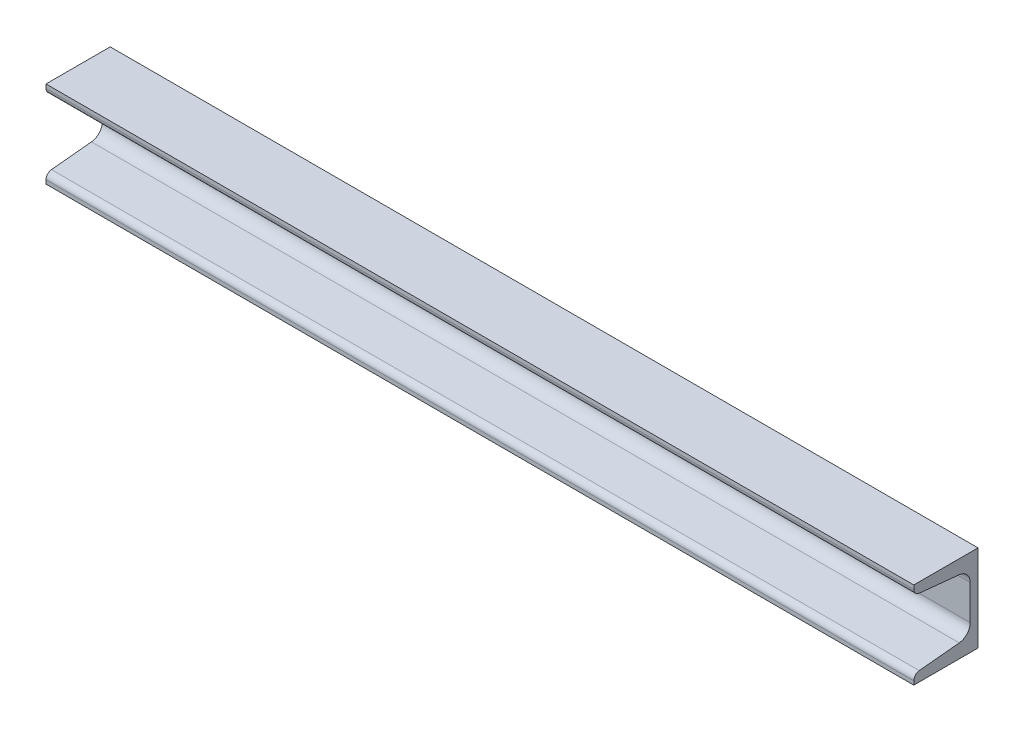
ISO-10303-21;
HEADER;
FILE_DESCRIPTION(('STEP AP214'),'2;1');
FILE_NAME('part.step','',(''),(''),'','','');
FILE_SCHEMA(('AUTOMOTIVE_DESIGN { 1 0 10303 214 1 1 1 1 }'));
ENDSEC;
DATA;
#1=APPLICATION_CONTEXT('core data for automotive mechanical design processes');
#2=APPLICATION_PROTOCOL_DEFINITION('international standard','automotive_design',2000,#1);
#3=PRODUCT_CONTEXT('',#1,'mechanical');
#4=PRODUCT('Part','Part','',(#3));
#5=PRODUCT_RELATED_PRODUCT_CATEGORY('part','',(#4));
#6=PRODUCT_DEFINITION_FORMATION('','',#4);
#7=PRODUCT_DEFINITION_CONTEXT('part definition',#1,'design');
#8=PRODUCT_DEFINITION('design','',#6,#7);
#9=PRODUCT_DEFINITION_SHAPE('','',#8);
#10=(LENGTH_UNIT() NAMED_UNIT(*) SI_UNIT(.MILLI.,.METRE.));
#11=(NAMED_UNIT(*) PLANE_ANGLE_UNIT() SI_UNIT($,.RADIAN.));
#12=(NAMED_UNIT(*) SI_UNIT($,.STERADIAN.) SOLID_ANGLE_UNIT());
#13=UNCERTAINTY_MEASURE_WITH_UNIT(LENGTH_MEASURE(1.E-05),#10,'distance_accuracy_value','');
#14=(GEOMETRIC_REPRESENTATION_CONTEXT(3) GLOBAL_UNCERTAINTY_ASSIGNED_CONTEXT((#13)) GLOBAL_UNIT_ASSIGNED_CONTEXT((#10,
#11,#12)) REPRESENTATION_CONTEXT('',''));
#15=CARTESIAN_POINT('',(0.,0.,0.));
#16=DIRECTION('',(0.,0.,1.));
#17=DIRECTION('',(1.,0.,0.));
#18=AXIS2_PLACEMENT_3D('',#15,#16,#17);
#19=CARTESIAN_POINT('',(500.,16.3749999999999,4.5));
#20=DIRECTION('',(0.,0.995037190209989,-0.0995037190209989));
#21=DIRECTION('',(0.,0.0995037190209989,0.995037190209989));
#22=AXIS2_PLACEMENT_3D('',#19,#20,#21);
#23=PLANE('',#22);
#24=DIRECTION('',(0.,-0.0995037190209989,-0.995037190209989));
#25=VECTOR('',#24,1.);
#26=CARTESIAN_POINT('',(500.,16.3749999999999,4.5));
#27=LINE('',#26,#25);
#28=CARTESIAN_POINT('',(500.,19.3098263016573,33.8482630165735));
#29=VERTEX_POINT('',#28);
#30=CARTESIAN_POINT('',(500.,17.0053473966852,10.803473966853));
#31=VERTEX_POINT('',#30);
#32=EDGE_CURVE('E180',#29,#31,#27,.T.);
#33=ORIENTED_EDGE('',*,*,#32,.F.);
#34=DIRECTION('',(-1.,0.,0.));
#35=VECTOR('',#34,1.);
#36=CARTESIAN_POINT('',(500.,19.3098263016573,33.8482630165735));
#37=LINE('',#36,#35);
#38=CARTESIAN_POINT('',(0.,19.3098263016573,33.8482630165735));
#39=VERTEX_POINT('',#38);
#40=EDGE_CURVE('E47',#29,#39,#37,.T.);
#41=ORIENTED_EDGE('',*,*,#40,.T.);
#42=DIRECTION('',(0.,-0.0995037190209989,-0.995037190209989));
#43=VECTOR('',#42,1.);
#44=CARTESIAN_POINT('',(0.,16.3749999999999,4.5));
#45=LINE('',#44,#43);
#46=CARTESIAN_POINT('',(0.,17.0053473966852,10.803473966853));
#47=VERTEX_POINT('',#46);
#48=EDGE_CURVE('E163',#39,#47,#45,.T.);
#49=ORIENTED_EDGE('',*,*,#48,.T.);
#50=DIRECTION('',(-1.,0.,0.));
#51=VECTOR('',#50,1.);
#52=CARTESIAN_POINT('',(500.,17.0053473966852,10.803473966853));
#53=LINE('',#52,#51);
#54=EDGE_CURVE('E194',#47,#31,#53,.F.);
#55=ORIENTED_EDGE('',*,*,#54,.T.);
#56=EDGE_LOOP('',(#33,#41,#49,#55));
#57=FACE_BOUND('',#56,.T.);
#58=ADVANCED_FACE('F39',(#57),#23,.F.);
#59=CARTESIAN_POINT('',(500.,-16.3750000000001,4.5));
#60=DIRECTION('',(0.,0.,-1.));
#61=DIRECTION('',(-1.,0.,0.));
#62=AXIS2_PLACEMENT_3D('',#59,#60,#61);
#63=PLANE('',#62);
#64=DIRECTION('',(0.,-1.,0.));
#65=VECTOR('',#64,1.);
#66=CARTESIAN_POINT('',(0.,-16.3750000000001,4.5));
#67=LINE('',#66,#65);
#68=CARTESIAN_POINT('',(0.,10.0400870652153,4.5));
#69=VERTEX_POINT('',#68);
#70=CARTESIAN_POINT('',(0.,-10.0400870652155,4.5));
#71=VERTEX_POINT('',#70);
#72=EDGE_CURVE('E165',#69,#71,#67,.T.);
#73=ORIENTED_EDGE('',*,*,#72,.T.);
#74=DIRECTION('',(-1.,0.,0.));
#75=VECTOR('',#74,1.);
#76=CARTESIAN_POINT('',(500.,-10.0400870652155,4.5));
#77=LINE('',#76,#75);
#78=CARTESIAN_POINT('',(500.,-10.0400870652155,4.5));
#79=VERTEX_POINT('',#78);
#80=EDGE_CURVE('E192',#71,#79,#77,.F.);
#81=ORIENTED_EDGE('',*,*,#80,.T.);
#82=DIRECTION('',(0.,-1.,0.));
#83=VECTOR('',#82,1.);
#84=CARTESIAN_POINT('',(500.,-16.3750000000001,4.5));
#85=LINE('',#84,#83);
#86=CARTESIAN_POINT('',(500.,10.0400870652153,4.5));
#87=VERTEX_POINT('',#86);
#88=EDGE_CURVE('E231',#87,#79,#85,.T.);
#89=ORIENTED_EDGE('',*,*,#88,.F.);
#90=DIRECTION('',(-1.,0.,0.));
#91=VECTOR('',#90,1.);
#92=CARTESIAN_POINT('',(1.11022302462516E-13,10.0400870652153,4.5));
#93=LINE('',#92,#91);
#94=EDGE_CURVE('E189',#87,#69,#93,.T.);
#95=ORIENTED_EDGE('',*,*,#94,.T.);
#96=EDGE_LOOP('',(#73,#81,#89,#95));
#97=FACE_BOUND('',#96,.T.);
#98=ADVANCED_FACE('F234',(#97),#63,.F.);
#99=CARTESIAN_POINT('',(500.,-16.3750000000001,4.5));
#100=DIRECTION('',(0.,-0.995037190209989,-0.0995037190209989));
#101=DIRECTION('',(0.,0.0995037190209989,-0.995037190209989));
#102=AXIS2_PLACEMENT_3D('',#99,#100,#101);
#103=PLANE('',#102);
#104=DIRECTION('',(0.,-0.0995037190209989,0.995037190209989));
#105=VECTOR('',#104,1.);
#106=CARTESIAN_POINT('',(0.,-16.3750000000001,4.5));
#107=LINE('',#106,#105);
#108=CARTESIAN_POINT('',(0.,-17.0053473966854,10.803473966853));
#109=VERTEX_POINT('',#108);
#110=CARTESIAN_POINT('',(0.,-19.3098263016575,33.8482630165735));
#111=VERTEX_POINT('',#110);
#112=EDGE_CURVE('E168',#109,#111,#107,.T.);
#113=ORIENTED_EDGE('',*,*,#112,.T.);
#114=DIRECTION('',(-1.,0.,0.));
#115=VECTOR('',#114,1.);
#116=CARTESIAN_POINT('',(500.,-19.3098263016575,33.8482630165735));
#117=LINE('',#116,#115);
#118=CARTESIAN_POINT('',(500.,-19.3098263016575,33.8482630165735));
#119=VERTEX_POINT('',#118);
#120=EDGE_CURVE('E212',#111,#119,#117,.F.);
#121=ORIENTED_EDGE('',*,*,#120,.T.);
#122=DIRECTION('',(0.,-0.0995037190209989,0.995037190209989));
#123=VECTOR('',#122,1.);
#124=CARTESIAN_POINT('',(500.,-16.3750000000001,4.5));
#125=LINE('',#124,#123);
#126=CARTESIAN_POINT('',(500.,-17.0053473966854,10.803473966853));
#127=VERTEX_POINT('',#126);
#128=EDGE_CURVE('E138',#127,#119,#125,.T.);
#129=ORIENTED_EDGE('',*,*,#128,.F.);
#130=DIRECTION('',(-1.,0.,0.));
#131=VECTOR('',#130,1.);
#132=CARTESIAN_POINT('',(1.11022302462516E-13,-17.0053473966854,10.803473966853));
#133=LINE('',#132,#131);
#134=EDGE_CURVE('E147',#127,#109,#133,.T.);
#135=ORIENTED_EDGE('',*,*,#134,.T.);
#136=EDGE_LOOP('',(#113,#121,#129,#135));
#137=FACE_BOUND('',#136,.T.);
#138=ADVANCED_FACE('F272',(#137),#103,.F.);
#139=CARTESIAN_POINT('',(500.,-19.6250000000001,37.));
#140=DIRECTION('',(0.,0.,-1.));
#141=DIRECTION('',(-1.,0.,0.));
#142=AXIS2_PLACEMENT_3D('',#139,#140,#141);
#143=PLANE('',#142);
#144=DIRECTION('',(0.,-1.,0.));
#145=VECTOR('',#144,1.);
#146=CARTESIAN_POINT('',(500.,-19.6250000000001,37.));
#147=LINE('',#146,#145);
#148=CARTESIAN_POINT('',(500.,-22.7924564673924,37.));
#149=VERTEX_POINT('',#148);
#150=CARTESIAN_POINT('',(500.,-25.0000000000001,37.));
#151=VERTEX_POINT('',#150);
#152=EDGE_CURVE('E126',#149,#151,#147,.T.);
#153=ORIENTED_EDGE('',*,*,#152,.F.);
#154=DIRECTION('',(-1.,0.,0.));
#155=VECTOR('',#154,1.);
#156=CARTESIAN_POINT('',(500.,-22.7924564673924,37.));
#157=LINE('',#156,#155);
#158=CARTESIAN_POINT('',(0.,-22.7924564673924,37.));
#159=VERTEX_POINT('',#158);
#160=EDGE_CURVE('E206',#149,#159,#157,.T.);
#161=ORIENTED_EDGE('',*,*,#160,.T.);
#162=DIRECTION('',(0.,-1.,0.));
#163=VECTOR('',#162,1.);
#164=CARTESIAN_POINT('',(0.,-19.6250000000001,37.));
#165=LINE('',#164,#163);
#166=CARTESIAN_POINT('',(0.,-25.0000000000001,37.));
#167=VERTEX_POINT('',#166);
#168=EDGE_CURVE('E144',#159,#167,#165,.T.);
#169=ORIENTED_EDGE('',*,*,#168,.T.);
#170=DIRECTION('',(-1.,0.,0.));
#171=VECTOR('',#170,1.);
#172=CARTESIAN_POINT('',(500.,-25.0000000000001,37.));
#173=LINE('',#172,#171);
#174=EDGE_CURVE('E141',#151,#167,#173,.T.);
#175=ORIENTED_EDGE('',*,*,#174,.F.);
#176=EDGE_LOOP('',(#153,#161,#169,#175));
#177=FACE_BOUND('',#176,.T.);
#178=ADVANCED_FACE('F142',(#177),#143,.F.);
#179=CARTESIAN_POINT('',(500.,-25.0000000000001,0.));
#180=DIRECTION('',(0.,1.,0.));
#181=DIRECTION('',(0.,0.,1.));
#182=AXIS2_PLACEMENT_3D('',#179,#180,#181);
#183=PLANE('',#182);
#184=DIRECTION('',(0.,0.,-1.));
#185=VECTOR('',#184,1.);
#186=CARTESIAN_POINT('',(0.,-25.0000000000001,0.));
#187=LINE('',#186,#185);
#188=CARTESIAN_POINT('',(0.,-25.0000000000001,0.));
#189=VERTEX_POINT('',#188);
#190=EDGE_CURVE('E172',#167,#189,#187,.T.);
#191=ORIENTED_EDGE('',*,*,#190,.T.);
#192=DIRECTION('',(-1.,0.,0.));
#193=VECTOR('',#192,1.);
#194=CARTESIAN_POINT('',(500.,-25.0000000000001,0.));
#195=LINE('',#194,#193);
#196=CARTESIAN_POINT('',(500.,-25.0000000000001,0.));
#197=VERTEX_POINT('',#196);
#198=EDGE_CURVE('E148',#197,#189,#195,.T.);
#199=ORIENTED_EDGE('',*,*,#198,.F.);
#200=DIRECTION('',(0.,0.,-1.));
#201=VECTOR('',#200,1.);
#202=CARTESIAN_POINT('',(500.,-25.0000000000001,0.));
#203=LINE('',#202,#201);
#204=EDGE_CURVE('E131',#151,#197,#203,.T.);
#205=ORIENTED_EDGE('',*,*,#204,.F.);
#206=ORIENTED_EDGE('',*,*,#174,.T.);
#207=EDGE_LOOP('',(#191,#199,#205,#206));
#208=FACE_BOUND('',#207,.T.);
#209=ADVANCED_FACE('F150',(#208),#183,.F.);
#210=CARTESIAN_POINT('',(500.,24.9999999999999,0.));
#211=DIRECTION('',(0.,0.,1.));
#212=DIRECTION('',(0.,-1.,0.));
#213=AXIS2_PLACEMENT_3D('',#210,#211,#212);
#214=PLANE('',#213);
#215=DIRECTION('',(0.,1.,0.));
#216=VECTOR('',#215,1.);
#217=CARTESIAN_POINT('',(0.,24.9999999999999,0.));
#218=LINE('',#217,#216);
#219=CARTESIAN_POINT('',(0.,24.9999999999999,0.));
#220=VERTEX_POINT('',#219);
#221=EDGE_CURVE('E174',#189,#220,#218,.T.);
#222=ORIENTED_EDGE('',*,*,#221,.T.);
#223=DIRECTION('',(-1.,0.,0.));
#224=VECTOR('',#223,1.);
#225=CARTESIAN_POINT('',(500.,24.9999999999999,0.));
#226=LINE('',#225,#224);
#227=CARTESIAN_POINT('',(500.,24.9999999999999,0.));
#228=VERTEX_POINT('',#227);
#229=EDGE_CURVE('E183',#228,#220,#226,.T.);
#230=ORIENTED_EDGE('',*,*,#229,.F.);
#231=DIRECTION('',(0.,1.,0.));
#232=VECTOR('',#231,1.);
#233=CARTESIAN_POINT('',(500.,24.9999999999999,0.));
#234=LINE('',#233,#232);
#235=EDGE_CURVE('E153',#197,#228,#234,.T.);
#236=ORIENTED_EDGE('',*,*,#235,.F.);
#237=ORIENTED_EDGE('',*,*,#198,.T.);
#238=EDGE_LOOP('',(#222,#230,#236,#237));
#239=FACE_BOUND('',#238,.T.);
#240=ADVANCED_FACE('F248',(#239),#214,.F.);
#241=CARTESIAN_POINT('',(500.,24.9999999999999,0.));
#242=DIRECTION('',(0.,-1.,0.));
#243=DIRECTION('',(0.,0.,-1.));
#244=AXIS2_PLACEMENT_3D('',#241,#242,#243);
#245=PLANE('',#244);
#246=DIRECTION('',(0.,0.,1.));
#247=VECTOR('',#246,1.);
#248=CARTESIAN_POINT('',(0.,24.9999999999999,0.));
#249=LINE('',#248,#247);
#250=CARTESIAN_POINT('',(0.,24.9999999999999,37.));
#251=VERTEX_POINT('',#250);
#252=EDGE_CURVE('E176',#220,#251,#249,.T.);
#253=ORIENTED_EDGE('',*,*,#252,.T.);
#254=DIRECTION('',(-1.,0.,0.));
#255=VECTOR('',#254,1.);
#256=CARTESIAN_POINT('',(500.,24.9999999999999,37.));
#257=LINE('',#256,#255);
#258=CARTESIAN_POINT('',(500.,24.9999999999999,37.));
#259=VERTEX_POINT('',#258);
#260=EDGE_CURVE('E162',#259,#251,#257,.T.);
#261=ORIENTED_EDGE('',*,*,#260,.F.);
#262=DIRECTION('',(0.,0.,1.));
#263=VECTOR('',#262,1.);
#264=CARTESIAN_POINT('',(500.,24.9999999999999,0.));
#265=LINE('',#264,#263);
#266=EDGE_CURVE('E155',#228,#259,#265,.T.);
#267=ORIENTED_EDGE('',*,*,#266,.F.);
#268=ORIENTED_EDGE('',*,*,#229,.T.);
#269=EDGE_LOOP('',(#253,#261,#267,#268));
#270=FACE_BOUND('',#269,.T.);
#271=ADVANCED_FACE('F253',(#270),#245,.F.);
#272=CARTESIAN_POINT('',(500.,19.6249999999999,37.));
#273=DIRECTION('',(0.,0.,-1.));
#274=DIRECTION('',(-1.,0.,0.));
#275=AXIS2_PLACEMENT_3D('',#272,#273,#274);
#276=PLANE('',#275);
#277=DIRECTION('',(0.,-1.,0.));
#278=VECTOR('',#277,1.);
#279=CARTESIAN_POINT('',(0.,19.6249999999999,37.));
#280=LINE('',#279,#278);
#281=CARTESIAN_POINT('',(0.,22.7924564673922,37.));
#282=VERTEX_POINT('',#281);
#283=EDGE_CURVE('E178',#251,#282,#280,.T.);
#284=ORIENTED_EDGE('',*,*,#283,.T.);
#285=DIRECTION('',(-1.,0.,0.));
#286=VECTOR('',#285,1.);
#287=CARTESIAN_POINT('',(500.,22.7924564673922,37.));
#288=LINE('',#287,#286);
#289=CARTESIAN_POINT('',(500.,22.7924564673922,37.));
#290=VERTEX_POINT('',#289);
#291=EDGE_CURVE('E11',#282,#290,#288,.F.);
#292=ORIENTED_EDGE('',*,*,#291,.T.);
#293=DIRECTION('',(0.,-1.,0.));
#294=VECTOR('',#293,1.);
#295=CARTESIAN_POINT('',(500.,19.6249999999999,37.));
#296=LINE('',#295,#294);
#297=EDGE_CURVE('E160',#259,#290,#296,.T.);
#298=ORIENTED_EDGE('',*,*,#297,.F.);
#299=ORIENTED_EDGE('',*,*,#260,.T.);
#300=EDGE_LOOP('',(#284,#292,#298,#299));
#301=FACE_BOUND('',#300,.T.);
#302=ADVANCED_FACE('F254',(#301),#276,.F.);
#303=CARTESIAN_POINT('',(500.,15.9249999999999,0.));
#304=DIRECTION('',(1.,0.,0.));
#305=DIRECTION('',(0.,0.,-1.));
#306=AXIS2_PLACEMENT_3D('',#303,#304,#305);
#307=PLANE('',#306);
#308=ORIENTED_EDGE('',*,*,#128,.T.);
#309=CARTESIAN_POINT('',(500.,-22.7924564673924,33.5));
#310=DIRECTION('',(1.,0.,0.));
#311=DIRECTION('',(0.,0.,-1.));
#312=AXIS2_PLACEMENT_3D('',#309,#310,#311);
#313=CIRCLE('',#312,3.5);
#314=EDGE_CURVE('E134',#119,#149,#313,.T.);
#315=ORIENTED_EDGE('',*,*,#314,.T.);
#316=ORIENTED_EDGE('',*,*,#152,.T.);
#317=ORIENTED_EDGE('',*,*,#204,.T.);
#318=ORIENTED_EDGE('',*,*,#235,.T.);
#319=ORIENTED_EDGE('',*,*,#266,.T.);
#320=ORIENTED_EDGE('',*,*,#297,.T.);
#321=CARTESIAN_POINT('',(500.,22.7924564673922,33.5));
#322=DIRECTION('',(1.,0.,0.));
#323=DIRECTION('',(0.,0.,-1.));
#324=AXIS2_PLACEMENT_3D('',#321,#322,#323);
#325=CIRCLE('',#324,3.5);
#326=EDGE_CURVE('E59',#290,#29,#325,.T.);
#327=ORIENTED_EDGE('',*,*,#326,.T.);
#328=ORIENTED_EDGE('',*,*,#32,.T.);
#329=CARTESIAN_POINT('',(500.,10.0400870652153,11.5));
#330=DIRECTION('',(1.,0.,0.));
#331=DIRECTION('',(0.,0.,-1.));
#332=AXIS2_PLACEMENT_3D('',#329,#330,#331);
#333=CIRCLE('',#332,7.);
#334=EDGE_CURVE('E204',#31,#87,#333,.F.);
#335=ORIENTED_EDGE('',*,*,#334,.T.);
#336=ORIENTED_EDGE('',*,*,#88,.T.);
#337=CARTESIAN_POINT('',(500.,-10.0400870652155,11.5));
#338=DIRECTION('',(1.,0.,0.));
#339=DIRECTION('',(0.,0.,-1.));
#340=AXIS2_PLACEMENT_3D('',#337,#338,#339);
#341=CIRCLE('',#340,7.);
#342=EDGE_CURVE('E199',#79,#127,#341,.F.);
#343=ORIENTED_EDGE('',*,*,#342,.T.);
#344=EDGE_LOOP('',(#308,#315,#316,#317,#318,#319,#320,#327,#328,#335,#336,#343));
#345=FACE_BOUND('',#344,.T.);
#346=ADVANCED_FACE('F129',(#345),#307,.T.);
#347=CARTESIAN_POINT('',(0.,15.9249999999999,0.));
#348=DIRECTION('',(1.,0.,0.));
#349=DIRECTION('',(0.,0.,-1.));
#350=AXIS2_PLACEMENT_3D('',#347,#348,#349);
#351=PLANE('',#350);
#352=ORIENTED_EDGE('',*,*,#168,.F.);
#353=CARTESIAN_POINT('',(0.,-22.7924564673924,33.5));
#354=DIRECTION('',(1.,0.,0.));
#355=DIRECTION('',(0.,0.,-1.));
#356=AXIS2_PLACEMENT_3D('',#353,#354,#355);
#357=CIRCLE('',#356,3.5);
#358=EDGE_CURVE('E210',#159,#111,#357,.F.);
#359=ORIENTED_EDGE('',*,*,#358,.T.);
#360=ORIENTED_EDGE('',*,*,#112,.F.);
#361=CARTESIAN_POINT('',(0.,-10.0400870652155,11.5));
#362=DIRECTION('',(1.,0.,0.));
#363=DIRECTION('',(0.,0.,-1.));
#364=AXIS2_PLACEMENT_3D('',#361,#362,#363);
#365=CIRCLE('',#364,7.);
#366=EDGE_CURVE('E197',#109,#71,#365,.T.);
#367=ORIENTED_EDGE('',*,*,#366,.T.);
#368=ORIENTED_EDGE('',*,*,#72,.F.);
#369=CARTESIAN_POINT('',(0.,10.0400870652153,11.5));
#370=DIRECTION('',(1.,0.,0.));
#371=DIRECTION('',(0.,0.,-1.));
#372=AXIS2_PLACEMENT_3D('',#369,#370,#371);
#373=CIRCLE('',#372,7.);
#374=EDGE_CURVE('E201',#69,#47,#373,.T.);
#375=ORIENTED_EDGE('',*,*,#374,.T.);
#376=ORIENTED_EDGE('',*,*,#48,.F.);
#377=CARTESIAN_POINT('',(0.,22.7924564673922,33.5));
#378=DIRECTION('',(1.,0.,0.));
#379=DIRECTION('',(0.,0.,-1.));
#380=AXIS2_PLACEMENT_3D('',#377,#378,#379);
#381=CIRCLE('',#380,3.5);
#382=EDGE_CURVE('E208',#39,#282,#381,.F.);
#383=ORIENTED_EDGE('',*,*,#382,.T.);
#384=ORIENTED_EDGE('',*,*,#283,.F.);
#385=ORIENTED_EDGE('',*,*,#252,.F.);
#386=ORIENTED_EDGE('',*,*,#221,.F.);
#387=ORIENTED_EDGE('',*,*,#190,.F.);
#388=EDGE_LOOP('',(#352,#359,#360,#367,#368,#375,#376,#383,#384,#385,#386,#387));
#389=FACE_BOUND('',#388,.T.);
#390=ADVANCED_FACE('F221',(#389),#351,.F.);
#391=CARTESIAN_POINT('',(500.,-10.0400870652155,11.5));
#392=DIRECTION('',(1.,0.,0.));
#393=DIRECTION('',(0.,0.,-1.));
#394=AXIS2_PLACEMENT_3D('',#391,#392,#393);
#395=CYLINDRICAL_SURFACE('',#394,7.);
#396=ORIENTED_EDGE('',*,*,#342,.F.);
#397=ORIENTED_EDGE('',*,*,#80,.F.);
#398=ORIENTED_EDGE('',*,*,#366,.F.);
#399=ORIENTED_EDGE('',*,*,#134,.F.);
#400=EDGE_LOOP('',(#396,#397,#398,#399));
#401=FACE_BOUND('',#400,.T.);
#402=ADVANCED_FACE('F276',(#401),#395,.F.);
#403=CARTESIAN_POINT('',(500.,10.0400870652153,11.5));
#404=DIRECTION('',(1.,0.,0.));
#405=DIRECTION('',(0.,0.,-1.));
#406=AXIS2_PLACEMENT_3D('',#403,#404,#405);
#407=CYLINDRICAL_SURFACE('',#406,7.);
#408=ORIENTED_EDGE('',*,*,#334,.F.);
#409=ORIENTED_EDGE('',*,*,#54,.F.);
#410=ORIENTED_EDGE('',*,*,#374,.F.);
#411=ORIENTED_EDGE('',*,*,#94,.F.);
#412=EDGE_LOOP('',(#408,#409,#410,#411));
#413=FACE_BOUND('',#412,.T.);
#414=ADVANCED_FACE('F228',(#413),#407,.F.);
#415=CARTESIAN_POINT('',(500.,-22.7924564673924,33.5));
#416=DIRECTION('',(-1.,0.,0.));
#417=DIRECTION('',(0.,0.,1.));
#418=AXIS2_PLACEMENT_3D('',#415,#416,#417);
#419=CYLINDRICAL_SURFACE('',#418,3.5);
#420=ORIENTED_EDGE('',*,*,#314,.F.);
#421=ORIENTED_EDGE('',*,*,#120,.F.);
#422=ORIENTED_EDGE('',*,*,#358,.F.);
#423=ORIENTED_EDGE('',*,*,#160,.F.);
#424=EDGE_LOOP('',(#420,#421,#422,#423));
#425=FACE_BOUND('',#424,.T.);
#426=ADVANCED_FACE('F243',(#425),#419,.T.);
#427=CARTESIAN_POINT('',(500.,22.7924564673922,33.5));
#428=DIRECTION('',(-1.,0.,0.));
#429=DIRECTION('',(0.,0.,1.));
#430=AXIS2_PLACEMENT_3D('',#427,#428,#429);
#431=CYLINDRICAL_SURFACE('',#430,3.5);
#432=ORIENTED_EDGE('',*,*,#326,.F.);
#433=ORIENTED_EDGE('',*,*,#291,.F.);
#434=ORIENTED_EDGE('',*,*,#382,.F.);
#435=ORIENTED_EDGE('',*,*,#40,.F.);
#436=EDGE_LOOP('',(#432,#433,#434,#435));
#437=FACE_BOUND('',#436,.T.);
#438=ADVANCED_FACE('F41',(#437),#431,.T.);
#439=CLOSED_SHELL('',(#58,#98,#138,#178,#209,#240,#271,#302,#346,#390,#402,#414,#426,#438));
#440=MANIFOLD_SOLID_BREP('B2',#439);
#441=ADVANCED_BREP_SHAPE_REPRESENTATION('',(#18,#440),#14);
#442=SHAPE_DEFINITION_REPRESENTATION(#9,#441);
ENDSEC;
END-ISO-10303-21;
